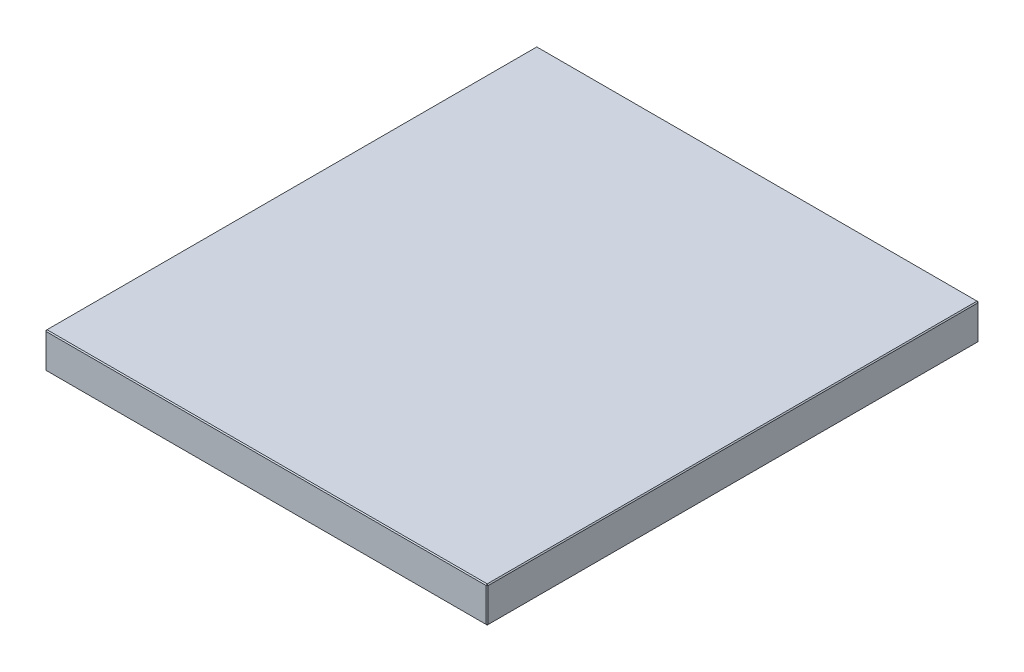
ISO-10303-21;
HEADER;
FILE_DESCRIPTION(('STEP AP214'),'2;1');
FILE_NAME('part.step','',(''),(''),'','','');
FILE_SCHEMA(('AUTOMOTIVE_DESIGN { 1 0 10303 214 1 1 1 1 }'));
ENDSEC;
DATA;
#1=APPLICATION_CONTEXT('core data for automotive mechanical design processes');
#2=APPLICATION_PROTOCOL_DEFINITION('international standard','automotive_design',2000,#1);
#3=PRODUCT_CONTEXT('',#1,'mechanical');
#4=PRODUCT('Part','Part','',(#3));
#5=PRODUCT_RELATED_PRODUCT_CATEGORY('part','',(#4));
#6=PRODUCT_DEFINITION_FORMATION('','',#4);
#7=PRODUCT_DEFINITION_CONTEXT('part definition',#1,'design');
#8=PRODUCT_DEFINITION('design','',#6,#7);
#9=PRODUCT_DEFINITION_SHAPE('','',#8);
#10=(LENGTH_UNIT() NAMED_UNIT(*) SI_UNIT(.MILLI.,.METRE.));
#11=(NAMED_UNIT(*) PLANE_ANGLE_UNIT() SI_UNIT($,.RADIAN.));
#12=(NAMED_UNIT(*) SI_UNIT($,.STERADIAN.) SOLID_ANGLE_UNIT());
#13=UNCERTAINTY_MEASURE_WITH_UNIT(LENGTH_MEASURE(1.E-05),#10,'distance_accuracy_value','');
#14=(GEOMETRIC_REPRESENTATION_CONTEXT(3) GLOBAL_UNCERTAINTY_ASSIGNED_CONTEXT((#13)) GLOBAL_UNIT_ASSIGNED_CONTEXT((#10,
#11,#12)) REPRESENTATION_CONTEXT('',''));
#15=CARTESIAN_POINT('',(0.,0.,0.));
#16=DIRECTION('',(0.,0.,1.));
#17=DIRECTION('',(1.,0.,0.));
#18=AXIS2_PLACEMENT_3D('',#15,#16,#17);
#19=CARTESIAN_POINT('',(-223.,36.,248.));
#20=DIRECTION('',(1.,0.,0.));
#21=DIRECTION('',(0.,0.,-1.));
#22=AXIS2_PLACEMENT_3D('',#19,#20,#21);
#23=PLANE('',#22);
#24=DIRECTION('',(0.,-1.,0.));
#25=VECTOR('',#24,1.);
#26=CARTESIAN_POINT('',(-223.,36.,-247.));
#27=LINE('',#26,#25);
#28=CARTESIAN_POINT('',(-223.,35.,-247.));
#29=VERTEX_POINT('',#28);
#30=CARTESIAN_POINT('',(-223.,0.999999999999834,-247.));
#31=VERTEX_POINT('',#30);
#32=EDGE_CURVE('E115',#29,#31,#27,.T.);
#33=ORIENTED_EDGE('',*,*,#32,.T.);
#34=DIRECTION('',(0.,0.,1.));
#35=VECTOR('',#34,1.);
#36=CARTESIAN_POINT('',(-223.,0.999999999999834,248.));
#37=LINE('',#36,#35);
#38=CARTESIAN_POINT('',(-223.,0.999999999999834,247.));
#39=VERTEX_POINT('',#38);
#40=EDGE_CURVE('E111',#31,#39,#37,.T.);
#41=ORIENTED_EDGE('',*,*,#40,.T.);
#42=DIRECTION('',(0.,1.,0.));
#43=VECTOR('',#42,1.);
#44=CARTESIAN_POINT('',(-223.,36.,247.));
#45=LINE('',#44,#43);
#46=CARTESIAN_POINT('',(-223.,35.,247.));
#47=VERTEX_POINT('',#46);
#48=EDGE_CURVE('E104',#39,#47,#45,.T.);
#49=ORIENTED_EDGE('',*,*,#48,.T.);
#50=DIRECTION('',(0.,0.,-1.));
#51=VECTOR('',#50,1.);
#52=CARTESIAN_POINT('',(-223.,35.,-248.));
#53=LINE('',#52,#51);
#54=EDGE_CURVE('E108',#47,#29,#53,.T.);
#55=ORIENTED_EDGE('',*,*,#54,.T.);
#56=EDGE_LOOP('',(#33,#41,#49,#55));
#57=FACE_BOUND('',#56,.T.);
#58=ADVANCED_FACE('F16',(#57),#23,.F.);
#59=CARTESIAN_POINT('',(223.,36.,248.));
#60=DIRECTION('',(0.,0.,-1.));
#61=DIRECTION('',(-1.,0.,0.));
#62=AXIS2_PLACEMENT_3D('',#59,#60,#61);
#63=PLANE('',#62);
#64=DIRECTION('',(-1.,0.,0.));
#65=VECTOR('',#64,1.);
#66=CARTESIAN_POINT('',(-223.,35.,248.));
#67=LINE('',#66,#65);
#68=CARTESIAN_POINT('',(222.,35.,248.));
#69=VERTEX_POINT('',#68);
#70=CARTESIAN_POINT('',(-222.,35.,248.));
#71=VERTEX_POINT('',#70);
#72=EDGE_CURVE('E165',#69,#71,#67,.T.);
#73=ORIENTED_EDGE('',*,*,#72,.T.);
#74=DIRECTION('',(0.,-1.,0.));
#75=VECTOR('',#74,1.);
#76=CARTESIAN_POINT('',(-222.,36.,248.));
#77=LINE('',#76,#75);
#78=CARTESIAN_POINT('',(-222.,0.99999999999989,248.));
#79=VERTEX_POINT('',#78);
#80=EDGE_CURVE('E123',#71,#79,#77,.T.);
#81=ORIENTED_EDGE('',*,*,#80,.T.);
#82=DIRECTION('',(1.,0.,0.));
#83=VECTOR('',#82,1.);
#84=CARTESIAN_POINT('',(223.,0.99999999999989,248.));
#85=LINE('',#84,#83);
#86=CARTESIAN_POINT('',(222.,0.99999999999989,248.));
#87=VERTEX_POINT('',#86);
#88=EDGE_CURVE('E169',#79,#87,#85,.T.);
#89=ORIENTED_EDGE('',*,*,#88,.T.);
#90=DIRECTION('',(0.,1.,0.));
#91=VECTOR('',#90,1.);
#92=CARTESIAN_POINT('',(222.,36.,248.));
#93=LINE('',#92,#91);
#94=EDGE_CURVE('E167',#87,#69,#93,.T.);
#95=ORIENTED_EDGE('',*,*,#94,.T.);
#96=EDGE_LOOP('',(#73,#81,#89,#95));
#97=FACE_BOUND('',#96,.T.);
#98=ADVANCED_FACE('F276',(#97),#63,.F.);
#99=CARTESIAN_POINT('',(223.,36.,248.));
#100=DIRECTION('',(-1.,0.,0.));
#101=DIRECTION('',(0.,0.,1.));
#102=AXIS2_PLACEMENT_3D('',#99,#100,#101);
#103=PLANE('',#102);
#104=DIRECTION('',(0.,0.,-1.));
#105=VECTOR('',#104,1.);
#106=CARTESIAN_POINT('',(223.,0.99999999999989,248.));
#107=LINE('',#106,#105);
#108=CARTESIAN_POINT('',(223.,0.99999999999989,247.));
#109=VERTEX_POINT('',#108);
#110=CARTESIAN_POINT('',(223.,0.99999999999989,-247.));
#111=VERTEX_POINT('',#110);
#112=EDGE_CURVE('E160',#109,#111,#107,.T.);
#113=ORIENTED_EDGE('',*,*,#112,.T.);
#114=DIRECTION('',(0.,1.,0.));
#115=VECTOR('',#114,1.);
#116=CARTESIAN_POINT('',(223.,36.,-247.));
#117=LINE('',#116,#115);
#118=CARTESIAN_POINT('',(223.,35.,-247.));
#119=VERTEX_POINT('',#118);
#120=EDGE_CURVE('E162',#111,#119,#117,.T.);
#121=ORIENTED_EDGE('',*,*,#120,.T.);
#122=DIRECTION('',(0.,0.,1.));
#123=VECTOR('',#122,1.);
#124=CARTESIAN_POINT('',(223.,35.,248.));
#125=LINE('',#124,#123);
#126=CARTESIAN_POINT('',(223.,35.,247.));
#127=VERTEX_POINT('',#126);
#128=EDGE_CURVE('E156',#119,#127,#125,.T.);
#129=ORIENTED_EDGE('',*,*,#128,.T.);
#130=DIRECTION('',(0.,-1.,0.));
#131=VECTOR('',#130,1.);
#132=CARTESIAN_POINT('',(223.,36.,247.));
#133=LINE('',#132,#131);
#134=EDGE_CURVE('E158',#127,#109,#133,.T.);
#135=ORIENTED_EDGE('',*,*,#134,.T.);
#136=EDGE_LOOP('',(#113,#121,#129,#135));
#137=FACE_BOUND('',#136,.T.);
#138=ADVANCED_FACE('F255',(#137),#103,.F.);
#139=CARTESIAN_POINT('',(223.,36.,-248.));
#140=DIRECTION('',(0.,0.,1.));
#141=DIRECTION('',(1.,0.,0.));
#142=AXIS2_PLACEMENT_3D('',#139,#140,#141);
#143=PLANE('',#142);
#144=DIRECTION('',(0.,-1.,0.));
#145=VECTOR('',#144,1.);
#146=CARTESIAN_POINT('',(222.,36.,-248.));
#147=LINE('',#146,#145);
#148=CARTESIAN_POINT('',(222.,35.,-248.));
#149=VERTEX_POINT('',#148);
#150=CARTESIAN_POINT('',(222.,0.99999999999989,-248.));
#151=VERTEX_POINT('',#150);
#152=EDGE_CURVE('E149',#149,#151,#147,.T.);
#153=ORIENTED_EDGE('',*,*,#152,.T.);
#154=DIRECTION('',(-1.,0.,0.));
#155=VECTOR('',#154,1.);
#156=CARTESIAN_POINT('',(223.,0.99999999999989,-248.));
#157=LINE('',#156,#155);
#158=CARTESIAN_POINT('',(-222.,0.99999999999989,-248.));
#159=VERTEX_POINT('',#158);
#160=EDGE_CURVE('E154',#151,#159,#157,.T.);
#161=ORIENTED_EDGE('',*,*,#160,.T.);
#162=DIRECTION('',(0.,1.,0.));
#163=VECTOR('',#162,1.);
#164=CARTESIAN_POINT('',(-222.,36.,-248.));
#165=LINE('',#164,#163);
#166=CARTESIAN_POINT('',(-222.,35.,-248.));
#167=VERTEX_POINT('',#166);
#168=EDGE_CURVE('E151',#159,#167,#165,.T.);
#169=ORIENTED_EDGE('',*,*,#168,.T.);
#170=DIRECTION('',(1.,0.,0.));
#171=VECTOR('',#170,1.);
#172=CARTESIAN_POINT('',(223.,35.,-248.));
#173=LINE('',#172,#171);
#174=EDGE_CURVE('E147',#167,#149,#173,.T.);
#175=ORIENTED_EDGE('',*,*,#174,.T.);
#176=EDGE_LOOP('',(#153,#161,#169,#175));
#177=FACE_BOUND('',#176,.T.);
#178=ADVANCED_FACE('F285',(#177),#143,.F.);
#179=CARTESIAN_POINT('',(0.,36.,0.));
#180=DIRECTION('',(0.,1.,0.));
#181=DIRECTION('',(0.,0.,1.));
#182=AXIS2_PLACEMENT_3D('',#179,#180,#181);
#183=PLANE('',#182);
#184=DIRECTION('',(0.,0.,-1.));
#185=VECTOR('',#184,1.);
#186=CARTESIAN_POINT('',(222.,36.,-248.));
#187=LINE('',#186,#185);
#188=CARTESIAN_POINT('',(222.,36.,247.));
#189=VERTEX_POINT('',#188);
#190=CARTESIAN_POINT('',(222.,36.,-247.));
#191=VERTEX_POINT('',#190);
#192=EDGE_CURVE('E25',#189,#191,#187,.T.);
#193=ORIENTED_EDGE('',*,*,#192,.T.);
#194=DIRECTION('',(-1.,0.,0.));
#195=VECTOR('',#194,1.);
#196=CARTESIAN_POINT('',(-223.,36.,-247.));
#197=LINE('',#196,#195);
#198=CARTESIAN_POINT('',(-222.,36.,-247.));
#199=VERTEX_POINT('',#198);
#200=EDGE_CURVE('E10',#191,#199,#197,.T.);
#201=ORIENTED_EDGE('',*,*,#200,.T.);
#202=DIRECTION('',(0.,0.,1.));
#203=VECTOR('',#202,1.);
#204=CARTESIAN_POINT('',(-222.,36.,248.));
#205=LINE('',#204,#203);
#206=CARTESIAN_POINT('',(-222.,36.,247.));
#207=VERTEX_POINT('',#206);
#208=EDGE_CURVE('E181',#199,#207,#205,.T.);
#209=ORIENTED_EDGE('',*,*,#208,.T.);
#210=DIRECTION('',(1.,0.,0.));
#211=VECTOR('',#210,1.);
#212=CARTESIAN_POINT('',(223.,36.,247.));
#213=LINE('',#212,#211);
#214=EDGE_CURVE('E36',#207,#189,#213,.T.);
#215=ORIENTED_EDGE('',*,*,#214,.T.);
#216=EDGE_LOOP('',(#193,#201,#209,#215));
#217=FACE_BOUND('',#216,.T.);
#218=ADVANCED_FACE('F351',(#217),#183,.T.);
#219=CARTESIAN_POINT('',(0.,0.,0.));
#220=DIRECTION('',(0.,1.,0.));
#221=DIRECTION('',(0.,0.,1.));
#222=AXIS2_PLACEMENT_3D('',#219,#220,#221);
#223=PLANE('',#222);
#224=DIRECTION('',(0.,0.,1.));
#225=VECTOR('',#224,1.);
#226=CARTESIAN_POINT('',(222.,0.,0.));
#227=LINE('',#226,#225);
#228=CARTESIAN_POINT('',(222.,0.,-247.));
#229=VERTEX_POINT('',#228);
#230=CARTESIAN_POINT('',(222.,0.,247.));
#231=VERTEX_POINT('',#230);
#232=EDGE_CURVE('E172',#229,#231,#227,.T.);
#233=ORIENTED_EDGE('',*,*,#232,.T.);
#234=DIRECTION('',(-1.,0.,0.));
#235=VECTOR('',#234,1.);
#236=CARTESIAN_POINT('',(0.,0.,247.));
#237=LINE('',#236,#235);
#238=CARTESIAN_POINT('',(-222.,0.,247.));
#239=VERTEX_POINT('',#238);
#240=EDGE_CURVE('E178',#231,#239,#237,.T.);
#241=ORIENTED_EDGE('',*,*,#240,.T.);
#242=DIRECTION('',(0.,0.,-1.));
#243=VECTOR('',#242,1.);
#244=CARTESIAN_POINT('',(-222.,0.,0.));
#245=LINE('',#244,#243);
#246=CARTESIAN_POINT('',(-222.,0.,-247.));
#247=VERTEX_POINT('',#246);
#248=EDGE_CURVE('E176',#239,#247,#245,.T.);
#249=ORIENTED_EDGE('',*,*,#248,.T.);
#250=DIRECTION('',(1.,0.,0.));
#251=VECTOR('',#250,1.);
#252=CARTESIAN_POINT('',(0.,0.,-247.));
#253=LINE('',#252,#251);
#254=EDGE_CURVE('E174',#247,#229,#253,.T.);
#255=ORIENTED_EDGE('',*,*,#254,.T.);
#256=EDGE_LOOP('',(#233,#241,#249,#255));
#257=FACE_BOUND('',#256,.T.);
#258=ADVANCED_FACE('F247',(#257),#223,.F.);
#259=CARTESIAN_POINT('',(223.,36.,247.));
#260=DIRECTION('',(-0.707106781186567,0.,-0.707106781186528));
#261=DIRECTION('',(0.,-1.,0.));
#262=AXIS2_PLACEMENT_3D('',#259,#260,#261);
#263=PLANE('',#262);
#264=DIRECTION('',(-0.707106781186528,0.,0.707106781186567));
#265=VECTOR('',#264,1.);
#266=CARTESIAN_POINT('',(222.,35.,248.));
#267=LINE('',#266,#265);
#268=EDGE_CURVE('E20',#69,#127,#267,.F.);
#269=ORIENTED_EDGE('',*,*,#268,.F.);
#270=ORIENTED_EDGE('',*,*,#94,.F.);
#271=DIRECTION('',(0.707106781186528,0.,-0.707106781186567));
#272=VECTOR('',#271,1.);
#273=CARTESIAN_POINT('',(222.,0.99999999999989,248.));
#274=LINE('',#273,#272);
#275=EDGE_CURVE('E143',#109,#87,#274,.F.);
#276=ORIENTED_EDGE('',*,*,#275,.F.);
#277=ORIENTED_EDGE('',*,*,#134,.F.);
#278=EDGE_LOOP('',(#269,#270,#276,#277));
#279=FACE_BOUND('',#278,.T.);
#280=ADVANCED_FACE('F18',(#279),#263,.F.);
#281=CARTESIAN_POINT('',(222.,35.,248.));
#282=DIRECTION('',(0.577350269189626,0.577350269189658,0.577350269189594));
#283=DIRECTION('',(-0.707106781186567,0.707106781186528,0.));
#284=AXIS2_PLACEMENT_3D('',#281,#282,#283);
#285=PLANE('',#284);
#286=DIRECTION('',(0.,-0.707106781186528,0.707106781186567));
#287=VECTOR('',#286,1.);
#288=CARTESIAN_POINT('',(222.,35.,248.));
#289=LINE('',#288,#287);
#290=EDGE_CURVE('E227',#69,#189,#289,.F.);
#291=ORIENTED_EDGE('',*,*,#290,.F.);
#292=ORIENTED_EDGE('',*,*,#268,.T.);
#293=DIRECTION('',(-0.707106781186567,0.707106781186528,0.));
#294=VECTOR('',#293,1.);
#295=CARTESIAN_POINT('',(222.5,35.5,247.));
#296=LINE('',#295,#294);
#297=EDGE_CURVE('E229',#189,#127,#296,.F.);
#298=ORIENTED_EDGE('',*,*,#297,.F.);
#299=EDGE_LOOP('',(#291,#292,#298));
#300=FACE_BOUND('',#299,.T.);
#301=ADVANCED_FACE('F271',(#300),#285,.T.);
#302=CARTESIAN_POINT('',(222.,0.99999999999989,248.));
#303=DIRECTION('',(0.577350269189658,-0.577350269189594,0.577350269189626));
#304=DIRECTION('',(0.707106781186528,0.,-0.707106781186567));
#305=AXIS2_PLACEMENT_3D('',#302,#303,#304);
#306=PLANE('',#305);
#307=DIRECTION('',(-0.707106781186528,-0.707106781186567,0.));
#308=VECTOR('',#307,1.);
#309=CARTESIAN_POINT('',(222.5,0.499999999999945,247.));
#310=LINE('',#309,#308);
#311=EDGE_CURVE('E221',#109,#231,#310,.T.);
#312=ORIENTED_EDGE('',*,*,#311,.F.);
#313=ORIENTED_EDGE('',*,*,#275,.T.);
#314=DIRECTION('',(0.,0.707106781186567,0.707106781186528));
#315=VECTOR('',#314,1.);
#316=CARTESIAN_POINT('',(222.,0.99999999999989,248.));
#317=LINE('',#316,#315);
#318=EDGE_CURVE('E224',#231,#87,#317,.T.);
#319=ORIENTED_EDGE('',*,*,#318,.F.);
#320=EDGE_LOOP('',(#312,#313,#319));
#321=FACE_BOUND('',#320,.T.);
#322=ADVANCED_FACE('F236',(#321),#306,.T.);
#323=CARTESIAN_POINT('',(222.,36.,0.));
#324=DIRECTION('',(0.707106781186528,0.707106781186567,0.));
#325=DIRECTION('',(0.,0.,1.));
#326=AXIS2_PLACEMENT_3D('',#323,#324,#325);
#327=PLANE('',#326);
#328=ORIENTED_EDGE('',*,*,#297,.T.);
#329=ORIENTED_EDGE('',*,*,#128,.F.);
#330=DIRECTION('',(0.707106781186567,-0.707106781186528,0.));
#331=VECTOR('',#330,1.);
#332=CARTESIAN_POINT('',(223.,35.,-247.));
#333=LINE('',#332,#331);
#334=EDGE_CURVE('E216',#191,#119,#333,.T.);
#335=ORIENTED_EDGE('',*,*,#334,.F.);
#336=ORIENTED_EDGE('',*,*,#192,.F.);
#337=EDGE_LOOP('',(#328,#329,#335,#336));
#338=FACE_BOUND('',#337,.T.);
#339=ADVANCED_FACE('F266',(#338),#327,.T.);
#340=CARTESIAN_POINT('',(0.,36.,247.));
#341=DIRECTION('',(0.,0.707106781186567,0.707106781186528));
#342=DIRECTION('',(-1.,0.,0.));
#343=AXIS2_PLACEMENT_3D('',#340,#341,#342);
#344=PLANE('',#343);
#345=ORIENTED_EDGE('',*,*,#290,.T.);
#346=ORIENTED_EDGE('',*,*,#214,.F.);
#347=DIRECTION('',(0.,0.707106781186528,-0.707106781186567));
#348=VECTOR('',#347,1.);
#349=CARTESIAN_POINT('',(-222.,35.5,247.5));
#350=LINE('',#349,#348);
#351=EDGE_CURVE('E127',#71,#207,#350,.T.);
#352=ORIENTED_EDGE('',*,*,#351,.F.);
#353=ORIENTED_EDGE('',*,*,#72,.F.);
#354=EDGE_LOOP('',(#345,#346,#352,#353));
#355=FACE_BOUND('',#354,.T.);
#356=ADVANCED_FACE('F274',(#355),#344,.T.);
#357=CARTESIAN_POINT('',(-222.,36.,248.));
#358=DIRECTION('',(0.707106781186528,0.,-0.707106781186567));
#359=DIRECTION('',(0.,-1.,0.));
#360=AXIS2_PLACEMENT_3D('',#357,#358,#359);
#361=PLANE('',#360);
#362=DIRECTION('',(0.707106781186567,0.,0.707106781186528));
#363=VECTOR('',#362,1.);
#364=CARTESIAN_POINT('',(-222.,0.99999999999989,248.));
#365=LINE('',#364,#363);
#366=EDGE_CURVE('E128',#79,#39,#365,.F.);
#367=ORIENTED_EDGE('',*,*,#366,.F.);
#368=ORIENTED_EDGE('',*,*,#80,.F.);
#369=DIRECTION('',(-0.707106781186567,0.,-0.707106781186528));
#370=VECTOR('',#369,1.);
#371=CARTESIAN_POINT('',(-223.,35.,247.));
#372=LINE('',#371,#370);
#373=EDGE_CURVE('E119',#47,#71,#372,.F.);
#374=ORIENTED_EDGE('',*,*,#373,.F.);
#375=ORIENTED_EDGE('',*,*,#48,.F.);
#376=EDGE_LOOP('',(#367,#368,#374,#375));
#377=FACE_BOUND('',#376,.T.);
#378=ADVANCED_FACE('F121',(#377),#361,.F.);
#379=CARTESIAN_POINT('',(223.,0.99999999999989,248.));
#380=DIRECTION('',(0.,0.707106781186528,-0.707106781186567));
#381=DIRECTION('',(1.,0.,0.));
#382=AXIS2_PLACEMENT_3D('',#379,#380,#381);
#383=PLANE('',#382);
#384=ORIENTED_EDGE('',*,*,#318,.T.);
#385=ORIENTED_EDGE('',*,*,#88,.F.);
#386=DIRECTION('',(0.,-0.707106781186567,-0.707106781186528));
#387=VECTOR('',#386,1.);
#388=CARTESIAN_POINT('',(-222.,0.99999999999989,248.));
#389=LINE('',#388,#387);
#390=EDGE_CURVE('E212',#239,#79,#389,.F.);
#391=ORIENTED_EDGE('',*,*,#390,.F.);
#392=ORIENTED_EDGE('',*,*,#240,.F.);
#393=EDGE_LOOP('',(#384,#385,#391,#392));
#394=FACE_BOUND('',#393,.T.);
#395=ADVANCED_FACE('F244',(#394),#383,.F.);
#396=CARTESIAN_POINT('',(223.,0.99999999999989,248.));
#397=DIRECTION('',(-0.707106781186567,0.707106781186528,0.));
#398=DIRECTION('',(0.,0.,-1.));
#399=AXIS2_PLACEMENT_3D('',#396,#397,#398);
#400=PLANE('',#399);
#401=ORIENTED_EDGE('',*,*,#311,.T.);
#402=ORIENTED_EDGE('',*,*,#232,.F.);
#403=DIRECTION('',(0.707106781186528,0.707106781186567,0.));
#404=VECTOR('',#403,1.);
#405=CARTESIAN_POINT('',(222.5,0.499999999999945,-247.));
#406=LINE('',#405,#404);
#407=EDGE_CURVE('E209',#111,#229,#406,.F.);
#408=ORIENTED_EDGE('',*,*,#407,.F.);
#409=ORIENTED_EDGE('',*,*,#112,.F.);
#410=EDGE_LOOP('',(#401,#402,#408,#409));
#411=FACE_BOUND('',#410,.T.);
#412=ADVANCED_FACE('F252',(#411),#400,.F.);
#413=CARTESIAN_POINT('',(222.,36.,-248.));
#414=DIRECTION('',(-0.707106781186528,0.,0.707106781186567));
#415=DIRECTION('',(0.,-1.,0.));
#416=AXIS2_PLACEMENT_3D('',#413,#414,#415);
#417=PLANE('',#416);
#418=DIRECTION('',(0.707106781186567,0.,0.707106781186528));
#419=VECTOR('',#418,1.);
#420=CARTESIAN_POINT('',(223.,35.,-247.));
#421=LINE('',#420,#419);
#422=EDGE_CURVE('E218',#119,#149,#421,.F.);
#423=ORIENTED_EDGE('',*,*,#422,.F.);
#424=ORIENTED_EDGE('',*,*,#120,.F.);
#425=DIRECTION('',(-0.707106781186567,0.,-0.707106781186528));
#426=VECTOR('',#425,1.);
#427=CARTESIAN_POINT('',(222.,0.99999999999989,-248.));
#428=LINE('',#427,#426);
#429=EDGE_CURVE('E206',#151,#111,#428,.F.);
#430=ORIENTED_EDGE('',*,*,#429,.F.);
#431=ORIENTED_EDGE('',*,*,#152,.F.);
#432=EDGE_LOOP('',(#423,#424,#430,#431));
#433=FACE_BOUND('',#432,.T.);
#434=ADVANCED_FACE('F259',(#433),#417,.F.);
#435=CARTESIAN_POINT('',(223.,35.,-247.));
#436=DIRECTION('',(0.577350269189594,0.577350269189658,-0.577350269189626));
#437=DIRECTION('',(0.,0.707106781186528,0.707106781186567));
#438=AXIS2_PLACEMENT_3D('',#435,#436,#437);
#439=PLANE('',#438);
#440=ORIENTED_EDGE('',*,*,#334,.T.);
#441=ORIENTED_EDGE('',*,*,#422,.T.);
#442=DIRECTION('',(0.,0.707106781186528,0.707106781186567));
#443=VECTOR('',#442,1.);
#444=CARTESIAN_POINT('',(222.,35.5,-247.5));
#445=LINE('',#444,#443);
#446=EDGE_CURVE('E135',#191,#149,#445,.F.);
#447=ORIENTED_EDGE('',*,*,#446,.F.);
#448=EDGE_LOOP('',(#440,#441,#447));
#449=FACE_BOUND('',#448,.T.);
#450=ADVANCED_FACE('F326',(#449),#439,.T.);
#451=CARTESIAN_POINT('',(-223.,35.,247.));
#452=DIRECTION('',(-0.577350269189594,0.577350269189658,0.577350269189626));
#453=DIRECTION('',(0.,-0.707106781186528,0.707106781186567));
#454=AXIS2_PLACEMENT_3D('',#451,#452,#453);
#455=PLANE('',#454);
#456=ORIENTED_EDGE('',*,*,#373,.T.);
#457=ORIENTED_EDGE('',*,*,#351,.T.);
#458=DIRECTION('',(-0.707106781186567,-0.707106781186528,0.));
#459=VECTOR('',#458,1.);
#460=CARTESIAN_POINT('',(-223.,35.,247.));
#461=LINE('',#460,#459);
#462=EDGE_CURVE('E131',#47,#207,#461,.F.);
#463=ORIENTED_EDGE('',*,*,#462,.F.);
#464=EDGE_LOOP('',(#456,#457,#463));
#465=FACE_BOUND('',#464,.T.);
#466=ADVANCED_FACE('F132',(#465),#455,.T.);
#467=CARTESIAN_POINT('',(-222.,0.99999999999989,248.));
#468=DIRECTION('',(-0.577350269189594,-0.577350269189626,0.577350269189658));
#469=DIRECTION('',(0.,-0.707106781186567,-0.707106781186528));
#470=AXIS2_PLACEMENT_3D('',#467,#468,#469);
#471=PLANE('',#470);
#472=ORIENTED_EDGE('',*,*,#390,.T.);
#473=ORIENTED_EDGE('',*,*,#366,.T.);
#474=DIRECTION('',(-0.707106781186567,0.707106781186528,0.));
#475=VECTOR('',#474,1.);
#476=CARTESIAN_POINT('',(-222.5,0.499999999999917,247.));
#477=LINE('',#476,#475);
#478=EDGE_CURVE('E136',#239,#39,#477,.T.);
#479=ORIENTED_EDGE('',*,*,#478,.F.);
#480=EDGE_LOOP('',(#472,#473,#479));
#481=FACE_BOUND('',#480,.T.);
#482=ADVANCED_FACE('F319',(#481),#471,.T.);
#483=CARTESIAN_POINT('',(222.,0.99999999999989,-248.));
#484=DIRECTION('',(0.577350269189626,-0.577350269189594,-0.577350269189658));
#485=DIRECTION('',(-0.707106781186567,0.,-0.707106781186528));
#486=AXIS2_PLACEMENT_3D('',#483,#484,#485);
#487=PLANE('',#486);
#488=ORIENTED_EDGE('',*,*,#429,.T.);
#489=ORIENTED_EDGE('',*,*,#407,.T.);
#490=DIRECTION('',(0.,-0.707106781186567,0.707106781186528));
#491=VECTOR('',#490,1.);
#492=CARTESIAN_POINT('',(222.,0.99999999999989,-248.));
#493=LINE('',#492,#491);
#494=EDGE_CURVE('E199',#151,#229,#493,.T.);
#495=ORIENTED_EDGE('',*,*,#494,.F.);
#496=EDGE_LOOP('',(#488,#489,#495));
#497=FACE_BOUND('',#496,.T.);
#498=ADVANCED_FACE('F315',(#497),#487,.T.);
#499=CARTESIAN_POINT('',(0.,36.,-247.));
#500=DIRECTION('',(0.,0.707106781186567,-0.707106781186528));
#501=DIRECTION('',(1.,0.,0.));
#502=AXIS2_PLACEMENT_3D('',#499,#500,#501);
#503=PLANE('',#502);
#504=ORIENTED_EDGE('',*,*,#446,.T.);
#505=ORIENTED_EDGE('',*,*,#174,.F.);
#506=DIRECTION('',(0.,-0.707106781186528,-0.707106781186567));
#507=VECTOR('',#506,1.);
#508=CARTESIAN_POINT('',(-222.,35.,-248.));
#509=LINE('',#508,#507);
#510=EDGE_CURVE('E196',#199,#167,#509,.T.);
#511=ORIENTED_EDGE('',*,*,#510,.F.);
#512=ORIENTED_EDGE('',*,*,#200,.F.);
#513=EDGE_LOOP('',(#504,#505,#511,#512));
#514=FACE_BOUND('',#513,.T.);
#515=ADVANCED_FACE('F312',(#514),#503,.T.);
#516=CARTESIAN_POINT('',(-222.,36.,0.));
#517=DIRECTION('',(-0.707106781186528,0.707106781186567,0.));
#518=DIRECTION('',(0.,0.,-1.));
#519=AXIS2_PLACEMENT_3D('',#516,#517,#518);
#520=PLANE('',#519);
#521=ORIENTED_EDGE('',*,*,#462,.T.);
#522=ORIENTED_EDGE('',*,*,#208,.F.);
#523=DIRECTION('',(0.707106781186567,0.707106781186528,0.));
#524=VECTOR('',#523,1.);
#525=CARTESIAN_POINT('',(-222.5,35.5,-247.));
#526=LINE('',#525,#524);
#527=EDGE_CURVE('E139',#29,#199,#526,.T.);
#528=ORIENTED_EDGE('',*,*,#527,.F.);
#529=ORIENTED_EDGE('',*,*,#54,.F.);
#530=EDGE_LOOP('',(#521,#522,#528,#529));
#531=FACE_BOUND('',#530,.T.);
#532=ADVANCED_FACE('F138',(#531),#520,.T.);
#533=CARTESIAN_POINT('',(-223.,0.999999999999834,248.));
#534=DIRECTION('',(0.707106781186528,0.707106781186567,0.));
#535=DIRECTION('',(0.,0.,1.));
#536=AXIS2_PLACEMENT_3D('',#533,#534,#535);
#537=PLANE('',#536);
#538=ORIENTED_EDGE('',*,*,#478,.T.);
#539=ORIENTED_EDGE('',*,*,#40,.F.);
#540=DIRECTION('',(0.707106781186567,-0.707106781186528,0.));
#541=VECTOR('',#540,1.);
#542=CARTESIAN_POINT('',(-223.,0.999999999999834,-247.));
#543=LINE('',#542,#541);
#544=EDGE_CURVE('E192',#247,#31,#543,.F.);
#545=ORIENTED_EDGE('',*,*,#544,.F.);
#546=ORIENTED_EDGE('',*,*,#248,.F.);
#547=EDGE_LOOP('',(#538,#539,#545,#546));
#548=FACE_BOUND('',#547,.T.);
#549=ADVANCED_FACE('F305',(#548),#537,.F.);
#550=CARTESIAN_POINT('',(223.,0.99999999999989,-248.));
#551=DIRECTION('',(0.,0.707106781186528,0.707106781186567));
#552=DIRECTION('',(-1.,0.,0.));
#553=AXIS2_PLACEMENT_3D('',#550,#551,#552);
#554=PLANE('',#553);
#555=ORIENTED_EDGE('',*,*,#494,.T.);
#556=ORIENTED_EDGE('',*,*,#254,.F.);
#557=DIRECTION('',(0.,0.707106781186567,-0.707106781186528));
#558=VECTOR('',#557,1.);
#559=CARTESIAN_POINT('',(-222.,0.499999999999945,-247.5));
#560=LINE('',#559,#558);
#561=EDGE_CURVE('E189',#159,#247,#560,.F.);
#562=ORIENTED_EDGE('',*,*,#561,.F.);
#563=ORIENTED_EDGE('',*,*,#160,.F.);
#564=EDGE_LOOP('',(#555,#556,#562,#563));
#565=FACE_BOUND('',#564,.T.);
#566=ADVANCED_FACE('F301',(#565),#554,.F.);
#567=CARTESIAN_POINT('',(-222.,35.,-248.));
#568=DIRECTION('',(-0.577350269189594,0.577350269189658,-0.577350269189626));
#569=DIRECTION('',(0.,0.707106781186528,0.707106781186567));
#570=AXIS2_PLACEMENT_3D('',#567,#568,#569);
#571=PLANE('',#570);
#572=ORIENTED_EDGE('',*,*,#527,.T.);
#573=ORIENTED_EDGE('',*,*,#510,.T.);
#574=DIRECTION('',(0.707106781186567,0.,-0.707106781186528));
#575=VECTOR('',#574,1.);
#576=CARTESIAN_POINT('',(-222.,35.,-248.));
#577=LINE('',#576,#575);
#578=EDGE_CURVE('E187',#29,#167,#577,.T.);
#579=ORIENTED_EDGE('',*,*,#578,.F.);
#580=EDGE_LOOP('',(#572,#573,#579));
#581=FACE_BOUND('',#580,.T.);
#582=ADVANCED_FACE('F297',(#581),#571,.T.);
#583=CARTESIAN_POINT('',(-223.,0.999999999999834,-247.));
#584=DIRECTION('',(-0.577350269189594,-0.577350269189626,-0.577350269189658));
#585=DIRECTION('',(0.,0.707106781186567,-0.707106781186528));
#586=AXIS2_PLACEMENT_3D('',#583,#584,#585);
#587=PLANE('',#586);
#588=ORIENTED_EDGE('',*,*,#561,.T.);
#589=ORIENTED_EDGE('',*,*,#544,.T.);
#590=DIRECTION('',(-0.707106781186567,0.,0.707106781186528));
#591=VECTOR('',#590,1.);
#592=CARTESIAN_POINT('',(-223.,0.999999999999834,-247.));
#593=LINE('',#592,#591);
#594=EDGE_CURVE('E185',#159,#31,#593,.T.);
#595=ORIENTED_EDGE('',*,*,#594,.F.);
#596=EDGE_LOOP('',(#588,#589,#595));
#597=FACE_BOUND('',#596,.T.);
#598=ADVANCED_FACE('F293',(#597),#587,.T.);
#599=CARTESIAN_POINT('',(-223.,36.,-247.));
#600=DIRECTION('',(0.707106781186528,0.,0.707106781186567));
#601=DIRECTION('',(0.,-1.,0.));
#602=AXIS2_PLACEMENT_3D('',#599,#600,#601);
#603=PLANE('',#602);
#604=ORIENTED_EDGE('',*,*,#578,.T.);
#605=ORIENTED_EDGE('',*,*,#168,.F.);
#606=ORIENTED_EDGE('',*,*,#594,.T.);
#607=ORIENTED_EDGE('',*,*,#32,.F.);
#608=EDGE_LOOP('',(#604,#605,#606,#607));
#609=FACE_BOUND('',#608,.T.);
#610=ADVANCED_FACE('F290',(#609),#603,.F.);
#611=CLOSED_SHELL('',(#58,#98,#138,#178,#218,#258,#280,#301,#322,#339,#356,#378,#395,#412,#434,
#450,#466,#482,#498,#515,#532,#549,#566,#582,#598,#610));
#612=MANIFOLD_SOLID_BREP('B1',#611);
#613=ADVANCED_BREP_SHAPE_REPRESENTATION('',(#18,#612),#14);
#614=SHAPE_DEFINITION_REPRESENTATION(#9,#613);
ENDSEC;
END-ISO-10303-21;
